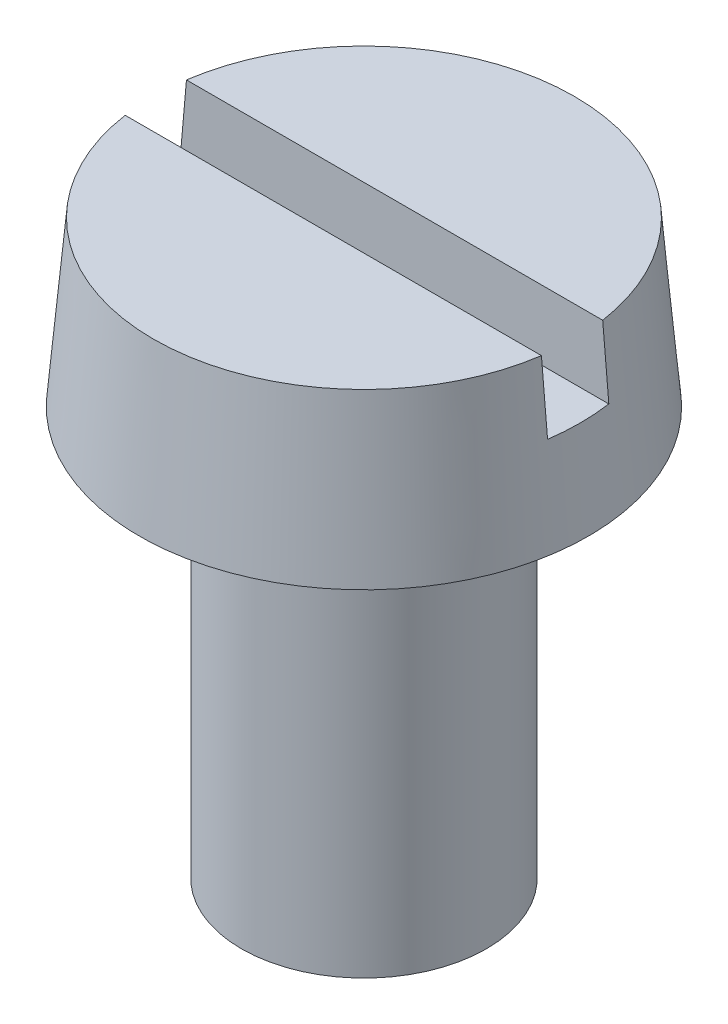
ISO-10303-21;
HEADER;
FILE_DESCRIPTION(('STEP AP214'),'2;1');
FILE_NAME('part.step','',(''),(''),'','','');
FILE_SCHEMA(('AUTOMOTIVE_DESIGN { 1 0 10303 214 1 1 1 1 }'));
ENDSEC;
DATA;
#1=APPLICATION_CONTEXT('core data for automotive mechanical design processes');
#2=APPLICATION_PROTOCOL_DEFINITION('international standard','automotive_design',2000,#1);
#3=PRODUCT_CONTEXT('',#1,'mechanical');
#4=PRODUCT('Part','Part','',(#3));
#5=PRODUCT_RELATED_PRODUCT_CATEGORY('part','',(#4));
#6=PRODUCT_DEFINITION_FORMATION('','',#4);
#7=PRODUCT_DEFINITION_CONTEXT('part definition',#1,'design');
#8=PRODUCT_DEFINITION('design','',#6,#7);
#9=PRODUCT_DEFINITION_SHAPE('','',#8);
#10=(LENGTH_UNIT() NAMED_UNIT(*) SI_UNIT(.MILLI.,.METRE.));
#11=(NAMED_UNIT(*) PLANE_ANGLE_UNIT() SI_UNIT($,.RADIAN.));
#12=(NAMED_UNIT(*) SI_UNIT($,.STERADIAN.) SOLID_ANGLE_UNIT());
#13=UNCERTAINTY_MEASURE_WITH_UNIT(LENGTH_MEASURE(1.E-05),#10,'distance_accuracy_value','');
#14=(GEOMETRIC_REPRESENTATION_CONTEXT(3) GLOBAL_UNCERTAINTY_ASSIGNED_CONTEXT((#13)) GLOBAL_UNIT_ASSIGNED_CONTEXT((#10,
#11,#12)) REPRESENTATION_CONTEXT('',''));
#15=CARTESIAN_POINT('',(0.,0.,0.));
#16=DIRECTION('',(0.,0.,1.));
#17=DIRECTION('',(1.,0.,0.));
#18=AXIS2_PLACEMENT_3D('',#15,#16,#17);
#19=CARTESIAN_POINT('',(3.29999999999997,1.15,0.375000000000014));
#20=DIRECTION('',(0.,-1.,0.));
#21=DIRECTION('',(1.,0.,0.));
#22=AXIS2_PLACEMENT_3D('',#19,#20,#21);
#23=PLANE('',#22);
#24=CARTESIAN_POINT('',(0.,1.14999999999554,0.));
#25=DIRECTION('',(0.,-1.,0.));
#26=DIRECTION('',(0.,0.,-1.));
#27=AXIS2_PLACEMENT_3D('',#24,#25,#26);
#28=CIRCLE('',#27,2.64938803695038);
#29=CARTESIAN_POINT('',(-2.62271461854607,1.14999999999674,0.375000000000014));
#30=VERTEX_POINT('',#29);
#31=CARTESIAN_POINT('',(-2.6227146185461,1.1499999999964,-0.375000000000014));
#32=VERTEX_POINT('',#31);
#33=EDGE_CURVE('E70',#30,#32,#28,.T.);
#34=ORIENTED_EDGE('',*,*,#33,.F.);
#35=DIRECTION('',(1.,0.,0.));
#36=VECTOR('',#35,1.);
#37=CARTESIAN_POINT('',(3.29999999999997,1.14999999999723,0.375000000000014));
#38=LINE('',#37,#36);
#39=CARTESIAN_POINT('',(2.6227146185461,1.14999999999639,0.375000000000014));
#40=VERTEX_POINT('',#39);
#41=EDGE_CURVE('E68',#30,#40,#38,.T.);
#42=ORIENTED_EDGE('',*,*,#41,.T.);
#43=CARTESIAN_POINT('',(0.,1.14999999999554,0.));
#44=DIRECTION('',(0.,-1.,0.));
#45=DIRECTION('',(0.,0.,-1.));
#46=AXIS2_PLACEMENT_3D('',#43,#44,#45);
#47=CIRCLE('',#46,2.64938803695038);
#48=CARTESIAN_POINT('',(2.62271461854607,1.14999999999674,-0.375000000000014));
#49=VERTEX_POINT('',#48);
#50=EDGE_CURVE('E19',#49,#40,#47,.T.);
#51=ORIENTED_EDGE('',*,*,#50,.F.);
#52=DIRECTION('',(-1.,0.,0.));
#53=VECTOR('',#52,1.);
#54=CARTESIAN_POINT('',(3.29999999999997,1.14999999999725,-0.375000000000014));
#55=LINE('',#54,#53);
#56=EDGE_CURVE('E63',#49,#32,#55,.T.);
#57=ORIENTED_EDGE('',*,*,#56,.T.);
#58=EDGE_LOOP('',(#34,#42,#51,#57));
#59=FACE_BOUND('',#58,.T.);
#60=ADVANCED_FACE('F16',(#59),#23,.F.);
#61=CARTESIAN_POINT('',(3.29999999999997,2.,0.375000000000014));
#62=DIRECTION('',(0.,0.,1.));
#63=DIRECTION('',(1.,0.,0.));
#64=AXIS2_PLACEMENT_3D('',#61,#62,#63);
#65=PLANE('',#64);
#66=DIRECTION('',(1.,0.,0.));
#67=VECTOR('',#66,1.);
#68=CARTESIAN_POINT('',(0.,2.,0.375000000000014));
#69=LINE('',#68,#67);
#70=CARTESIAN_POINT('',(-2.54757075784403,2.00000000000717,0.375000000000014));
#71=VERTEX_POINT('',#70);
#72=CARTESIAN_POINT('',(2.54757075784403,2.00000000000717,0.375000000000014));
#73=VERTEX_POINT('',#72);
#74=EDGE_CURVE('E72',#71,#73,#69,.T.);
#75=ORIENTED_EDGE('',*,*,#74,.T.);
#76=CARTESIAN_POINT('',(2.62271461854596,1.14999999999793,0.375000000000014));
#77=CARTESIAN_POINT('',(2.61019436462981,1.29166699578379,0.375000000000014));
#78=CARTESIAN_POINT('',(2.59767224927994,1.43333382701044,0.375000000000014));
#79=CARTESIAN_POINT('',(2.5726242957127,1.71666716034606,0.375000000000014));
#80=CARTESIAN_POINT('',(2.56009845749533,1.85833366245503,0.375000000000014));
#81=CARTESIAN_POINT('',(2.54757075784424,2.00000000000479,0.375000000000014));
#82=B_SPLINE_CURVE_WITH_KNOTS('',3,(#76,#77,#78,#79,#80,#81),.UNSPECIFIED.,.F.,.F.,(4,2,4),(0.,
0.426657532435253,0.853315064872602),.UNSPECIFIED.);
#83=EDGE_CURVE('E79',#40,#73,#82,.T.);
#84=ORIENTED_EDGE('',*,*,#83,.F.);
#85=ORIENTED_EDGE('',*,*,#41,.F.);
#86=CARTESIAN_POINT('',(-2.54757075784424,2.00000000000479,0.375000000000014));
#87=CARTESIAN_POINT('',(-2.56009845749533,1.85833366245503,0.375000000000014));
#88=CARTESIAN_POINT('',(-2.5726242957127,1.71666716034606,0.375000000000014));
#89=CARTESIAN_POINT('',(-2.59767224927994,1.43333382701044,0.375000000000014));
#90=CARTESIAN_POINT('',(-2.61019436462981,1.29166699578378,0.375000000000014));
#91=CARTESIAN_POINT('',(-2.62271461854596,1.14999999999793,0.375000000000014));
#92=B_SPLINE_CURVE_WITH_KNOTS('',3,(#86,#87,#88,#89,#90,#91),.UNSPECIFIED.,.F.,.F.,(4,2,4),(0.,
0.42665753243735,0.853315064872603),.UNSPECIFIED.);
#93=EDGE_CURVE('E110',#71,#30,#92,.T.);
#94=ORIENTED_EDGE('',*,*,#93,.F.);
#95=EDGE_LOOP('',(#75,#84,#85,#94));
#96=FACE_BOUND('',#95,.T.);
#97=ADVANCED_FACE('F119',(#96),#65,.F.);
#98=CARTESIAN_POINT('',(3.29999999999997,1.15,-0.375000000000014));
#99=DIRECTION('',(0.,0.,-1.));
#100=DIRECTION('',(-1.,0.,0.));
#101=AXIS2_PLACEMENT_3D('',#98,#99,#100);
#102=PLANE('',#101);
#103=CARTESIAN_POINT('',(2.54757075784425,2.00000000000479,-0.375000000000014));
#104=CARTESIAN_POINT('',(2.56009845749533,1.85833366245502,-0.375000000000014));
#105=CARTESIAN_POINT('',(2.5726242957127,1.71666716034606,-0.375000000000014));
#106=CARTESIAN_POINT('',(2.59767224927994,1.43333382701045,-0.375000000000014));
#107=CARTESIAN_POINT('',(2.61019436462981,1.29166699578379,-0.375000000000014));
#108=CARTESIAN_POINT('',(2.62271461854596,1.14999999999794,-0.375000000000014));
#109=B_SPLINE_CURVE_WITH_KNOTS('',3,(#103,#104,#105,#106,#107,#108),.UNSPECIFIED.,.F.,.F.,(4,2,
4),(0.,0.426657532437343,0.853315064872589),.UNSPECIFIED.);
#110=CARTESIAN_POINT('',(2.54757075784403,2.00000000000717,-0.375000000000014));
#111=VERTEX_POINT('',#110);
#112=EDGE_CURVE('E52',#111,#49,#109,.T.);
#113=ORIENTED_EDGE('',*,*,#112,.F.);
#114=DIRECTION('',(1.,0.,0.));
#115=VECTOR('',#114,1.);
#116=CARTESIAN_POINT('',(0.,2.,-0.375000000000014));
#117=LINE('',#116,#115);
#118=CARTESIAN_POINT('',(-2.54757075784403,2.00000000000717,-0.375000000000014));
#119=VERTEX_POINT('',#118);
#120=EDGE_CURVE('E75',#111,#119,#117,.F.);
#121=ORIENTED_EDGE('',*,*,#120,.T.);
#122=CARTESIAN_POINT('',(-2.62271461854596,1.14999999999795,-0.375000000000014));
#123=CARTESIAN_POINT('',(-2.61019436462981,1.2916669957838,-0.375000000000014));
#124=CARTESIAN_POINT('',(-2.59767224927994,1.43333382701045,-0.375000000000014));
#125=CARTESIAN_POINT('',(-2.5726242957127,1.71666716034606,-0.375000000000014));
#126=CARTESIAN_POINT('',(-2.56009845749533,1.85833366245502,-0.375000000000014));
#127=CARTESIAN_POINT('',(-2.54757075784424,2.00000000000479,-0.375000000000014));
#128=B_SPLINE_CURVE_WITH_KNOTS('',3,(#122,#123,#124,#125,#126,#127),.UNSPECIFIED.,.F.,.F.,(4,2,
4),(0.,0.426657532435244,0.853315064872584),.UNSPECIFIED.);
#129=EDGE_CURVE('E34',#32,#119,#128,.T.);
#130=ORIENTED_EDGE('',*,*,#129,.F.);
#131=ORIENTED_EDGE('',*,*,#56,.F.);
#132=EDGE_LOOP('',(#113,#121,#130,#131));
#133=FACE_BOUND('',#132,.T.);
#134=ADVANCED_FACE('F71',(#133),#102,.F.);
#135=CARTESIAN_POINT('',(0.,2.,0.));
#136=DIRECTION('',(0.,-1.,0.));
#137=DIRECTION('',(1.,0.,0.));
#138=AXIS2_PLACEMENT_3D('',#135,#136,#137);
#139=PLANE('',#138);
#140=CARTESIAN_POINT('',(0.,2.00000000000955,0.));
#141=DIRECTION('',(0.,-1.,0.));
#142=DIRECTION('',(0.,0.,-1.));
#143=AXIS2_PLACEMENT_3D('',#140,#141,#142);
#144=CIRCLE('',#143,2.5750226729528);
#145=EDGE_CURVE('E87',#73,#71,#144,.T.);
#146=ORIENTED_EDGE('',*,*,#145,.F.);
#147=ORIENTED_EDGE('',*,*,#74,.F.);
#148=EDGE_LOOP('',(#146,#147));
#149=FACE_BOUND('',#148,.T.);
#150=ADVANCED_FACE('F129',(#149),#139,.F.);
#151=CARTESIAN_POINT('',(0.,2.,0.));
#152=DIRECTION('',(0.,-1.,0.));
#153=DIRECTION('',(1.,0.,0.));
#154=AXIS2_PLACEMENT_3D('',#151,#152,#153);
#155=PLANE('',#154);
#156=ORIENTED_EDGE('',*,*,#120,.F.);
#157=CARTESIAN_POINT('',(0.,2.00000000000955,0.));
#158=DIRECTION('',(0.,-1.,0.));
#159=DIRECTION('',(0.,0.,-1.));
#160=AXIS2_PLACEMENT_3D('',#157,#158,#159);
#161=CIRCLE('',#160,2.5750226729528);
#162=EDGE_CURVE('E59',#119,#111,#161,.T.);
#163=ORIENTED_EDGE('',*,*,#162,.F.);
#164=EDGE_LOOP('',(#156,#163));
#165=FACE_BOUND('',#164,.T.);
#166=ADVANCED_FACE('F106',(#165),#155,.F.);
#167=CARTESIAN_POINT('',(0.,5.6843418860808E-11,0.));
#168=DIRECTION('',(0.,-1.,0.));
#169=DIRECTION('',(0.,0.,-1.));
#170=AXIS2_PLACEMENT_3D('',#167,#168,#169);
#171=CONICAL_SURFACE('',#170,2.74999999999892,0.0872664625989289);
#172=ORIENTED_EDGE('',*,*,#83,.T.);
#173=ORIENTED_EDGE('',*,*,#145,.T.);
#174=ORIENTED_EDGE('',*,*,#93,.T.);
#175=ORIENTED_EDGE('',*,*,#33,.T.);
#176=ORIENTED_EDGE('',*,*,#129,.T.);
#177=ORIENTED_EDGE('',*,*,#162,.T.);
#178=ORIENTED_EDGE('',*,*,#112,.T.);
#179=ORIENTED_EDGE('',*,*,#50,.T.);
#180=EDGE_LOOP('',(#172,#173,#174,#175,#176,#177,#178,#179));
#181=FACE_BOUND('',#180,.T.);
#182=CARTESIAN_POINT('',(0.,0.,0.));
#183=DIRECTION('',(0.,-1.,0.));
#184=DIRECTION('',(0.,0.,-1.));
#185=AXIS2_PLACEMENT_3D('',#182,#183,#184);
#186=CIRCLE('',#185,2.75000000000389);
#187=CARTESIAN_POINT('',(0.,0.,-2.75000000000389));
#188=VERTEX_POINT('',#187);
#189=EDGE_CURVE('E83',#188,#188,#186,.T.);
#190=ORIENTED_EDGE('',*,*,#189,.F.);
#191=EDGE_LOOP('',(#190));
#192=FACE_BOUND('',#191,.T.);
#193=ADVANCED_FACE('F55',(#181,#192),#171,.T.);
#194=CARTESIAN_POINT('',(0.,0.,0.));
#195=DIRECTION('',(0.,-1.,0.));
#196=DIRECTION('',(1.,0.,0.));
#197=AXIS2_PLACEMENT_3D('',#194,#195,#196);
#198=PLANE('',#197);
#199=ORIENTED_EDGE('',*,*,#189,.T.);
#200=EDGE_LOOP('',(#199));
#201=FACE_BOUND('',#200,.T.);
#202=CARTESIAN_POINT('',(0.,0.,0.));
#203=DIRECTION('',(0.,-1.,0.));
#204=DIRECTION('',(1.,0.,0.));
#205=AXIS2_PLACEMENT_3D('',#202,#203,#204);
#206=CIRCLE('',#205,1.5);
#207=CARTESIAN_POINT('',(1.5,0.,0.));
#208=VERTEX_POINT('',#207);
#209=EDGE_CURVE('E25',#208,#208,#206,.T.);
#210=ORIENTED_EDGE('',*,*,#209,.F.);
#211=EDGE_LOOP('',(#210));
#212=FACE_BOUND('',#211,.T.);
#213=ADVANCED_FACE('F105',(#201,#212),#198,.T.);
#214=CARTESIAN_POINT('',(0.,-5.,0.));
#215=DIRECTION('',(0.,-1.,0.));
#216=DIRECTION('',(1.,0.,0.));
#217=AXIS2_PLACEMENT_3D('',#214,#215,#216);
#218=PLANE('',#217);
#219=CARTESIAN_POINT('',(0.,-5.,0.));
#220=DIRECTION('',(0.,-1.,0.));
#221=DIRECTION('',(1.,0.,0.));
#222=AXIS2_PLACEMENT_3D('',#219,#220,#221);
#223=CIRCLE('',#222,1.5);
#224=CARTESIAN_POINT('',(1.5,-5.,0.));
#225=VERTEX_POINT('',#224);
#226=EDGE_CURVE('E11',#225,#225,#223,.F.);
#227=ORIENTED_EDGE('',*,*,#226,.F.);
#228=EDGE_LOOP('',(#227));
#229=FACE_BOUND('',#228,.T.);
#230=ADVANCED_FACE('F132',(#229),#218,.T.);
#231=CARTESIAN_POINT('',(0.,2.35,0.));
#232=DIRECTION('',(0.,-1.,0.));
#233=DIRECTION('',(1.,0.,0.));
#234=AXIS2_PLACEMENT_3D('',#231,#232,#233);
#235=CYLINDRICAL_SURFACE('',#234,1.5);
#236=ORIENTED_EDGE('',*,*,#226,.T.);
#237=EDGE_LOOP('',(#236));
#238=FACE_BOUND('',#237,.T.);
#239=ORIENTED_EDGE('',*,*,#209,.T.);
#240=EDGE_LOOP('',(#239));
#241=FACE_BOUND('',#240,.T.);
#242=ADVANCED_FACE('F130',(#238,#241),#235,.T.);
#243=CLOSED_SHELL('',(#60,#97,#134,#150,#166,#193,#213,#230,#242));
#244=MANIFOLD_SOLID_BREP('B1',#243);
#245=ADVANCED_BREP_SHAPE_REPRESENTATION('',(#18,#244),#14);
#246=SHAPE_DEFINITION_REPRESENTATION(#9,#245);
ENDSEC;
END-ISO-10303-21;
